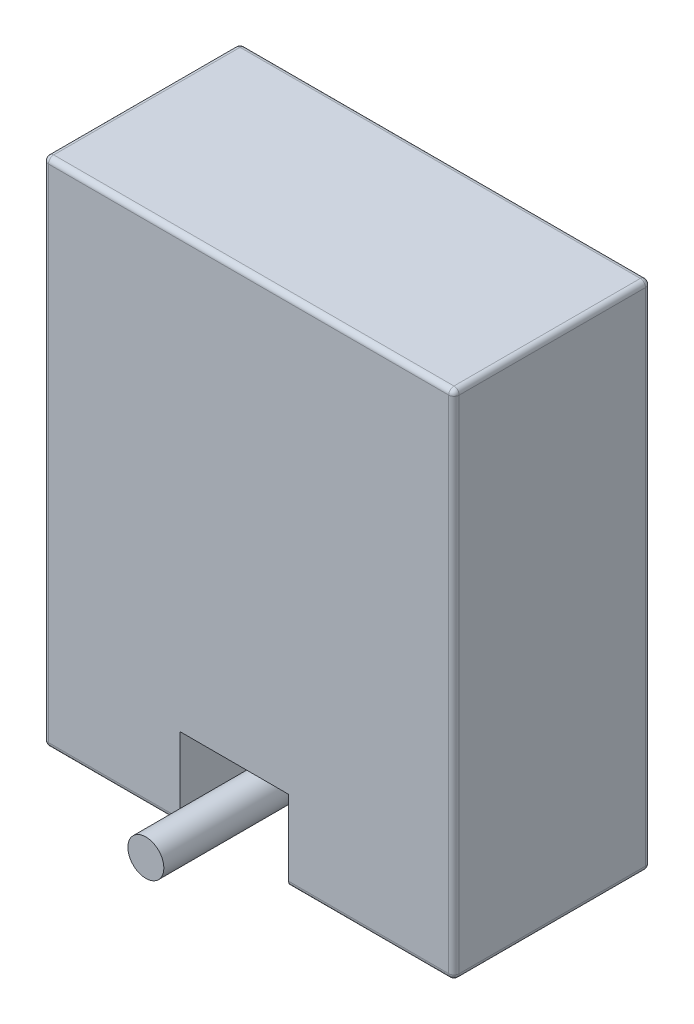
from build123d import *

# Parameters (mm, degrees)
SKETCH1_W           = 29.8196
SKETCH1_H           = 37.1348
BOSS_EXTRUDE1_DEPTH = 14.2875
FILLET1_R           = 0.381
SKETCH2_W           = 7.886508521
SKETCH2_H           = 5.842411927
CUT_EXTRUDE1_DEPTH  = 6.35
SKETCH3_R           = 1.304916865
BOSS_EXTRUDE2_DEPTH = 12.7


with BuildPart() as part:
    # Sketch1 → Boss-Extrude1 (new body)
    with BuildSketch(Plane.XY):
        with Locations((14.9098, 18.5674)):
            Rectangle(SKETCH1_W, SKETCH1_H)
    extrude(amount=-BOSS_EXTRUDE1_DEPTH)

    # Fillet1
    fillet1_edges = [part.edges().sort_by_distance(p)[0] for p in [
        (29.8196, 18.5674, -14.2875),
        (14.9098, 37.1348, -14.2875),
        (0, 18.5674, -14.2875),
        (14.9098, 37.1348, 0),
        (29.8196, 18.5674, 0),
        (14.9098, 0, 0),
        (0, 18.5674, 0),
        (14.9098, 0, -14.2875),
        (0, 37.1348, -7.14375),
        (29.8196, 37.1348, -7.14375),
        (29.8196, 0, -7.14375),
        (0, 0, -7.14375),
    ]]
    fillet(fillet1_edges, radius=FILLET1_R)

    # Sketch2 → Cut-Extrude1 (cut)
    with BuildSketch(Plane.XY):
        with Locations((13.865370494, 2.921205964)):
            Rectangle(SKETCH2_W, SKETCH2_H)
    extrude(amount=-CUT_EXTRUDE1_DEPTH, mode=Mode.SUBTRACT)

    # Sketch3 → Boss-Extrude2 (add)
    with BuildSketch(Plane.XY.offset(-6.35)):
        with Locations((13.801425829, 3.028846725)):
            Circle(SKETCH3_R)
    extrude(amount=BOSS_EXTRUDE2_DEPTH)


solid = part.part
